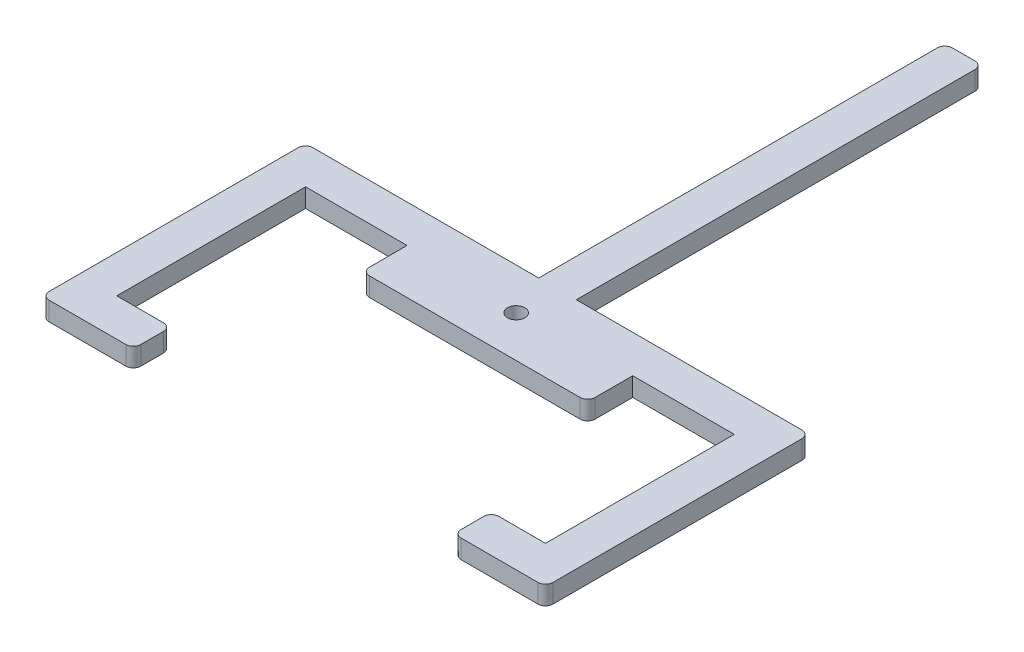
ISO-10303-21;
HEADER;
FILE_DESCRIPTION(('STEP AP214'),'2;1');
FILE_NAME('part.step','',(''),(''),'','','');
FILE_SCHEMA(('AUTOMOTIVE_DESIGN { 1 0 10303 214 1 1 1 1 }'));
ENDSEC;
DATA;
#1=APPLICATION_CONTEXT('core data for automotive mechanical design processes');
#2=APPLICATION_PROTOCOL_DEFINITION('international standard','automotive_design',2000,#1);
#3=PRODUCT_CONTEXT('',#1,'mechanical');
#4=PRODUCT('Part','Part','',(#3));
#5=PRODUCT_RELATED_PRODUCT_CATEGORY('part','',(#4));
#6=PRODUCT_DEFINITION_FORMATION('','',#4);
#7=PRODUCT_DEFINITION_CONTEXT('part definition',#1,'design');
#8=PRODUCT_DEFINITION('design','',#6,#7);
#9=PRODUCT_DEFINITION_SHAPE('','',#8);
#10=(LENGTH_UNIT() NAMED_UNIT(*) SI_UNIT(.MILLI.,.METRE.));
#11=(NAMED_UNIT(*) PLANE_ANGLE_UNIT() SI_UNIT($,.RADIAN.));
#12=(NAMED_UNIT(*) SI_UNIT($,.STERADIAN.) SOLID_ANGLE_UNIT());
#13=UNCERTAINTY_MEASURE_WITH_UNIT(LENGTH_MEASURE(1.E-05),#10,'distance_accuracy_value','');
#14=(GEOMETRIC_REPRESENTATION_CONTEXT(3) GLOBAL_UNCERTAINTY_ASSIGNED_CONTEXT((#13)) GLOBAL_UNIT_ASSIGNED_CONTEXT((#10,
#11,#12)) REPRESENTATION_CONTEXT('',''));
#15=CARTESIAN_POINT('',(0.,0.,0.));
#16=DIRECTION('',(0.,0.,1.));
#17=DIRECTION('',(1.,0.,0.));
#18=AXIS2_PLACEMENT_3D('',#15,#16,#17);
#19=CARTESIAN_POINT('',(39.37,3.175,74.93));
#20=DIRECTION('',(0.,0.,-1.));
#21=DIRECTION('',(-1.,0.,0.));
#22=AXIS2_PLACEMENT_3D('',#19,#20,#21);
#23=PLANE('',#22);
#24=DIRECTION('',(0.,-1.,0.));
#25=VECTOR('',#24,1.);
#26=CARTESIAN_POINT('',(22.225,3.175,74.93));
#27=LINE('',#26,#25);
#28=CARTESIAN_POINT('',(22.225,3.175,74.93));
#29=VERTEX_POINT('',#28);
#30=CARTESIAN_POINT('',(22.225,0.,74.93));
#31=VERTEX_POINT('',#30);
#32=EDGE_CURVE('E250',#29,#31,#27,.T.);
#33=ORIENTED_EDGE('',*,*,#32,.T.);
#34=DIRECTION('',(1.,0.,0.));
#35=VECTOR('',#34,1.);
#36=CARTESIAN_POINT('',(39.37,0.,74.93));
#37=LINE('',#36,#35);
#38=CARTESIAN_POINT('',(39.37,0.,74.93));
#39=VERTEX_POINT('',#38);
#40=EDGE_CURVE('E254',#31,#39,#37,.T.);
#41=ORIENTED_EDGE('',*,*,#40,.T.);
#42=DIRECTION('',(0.,-1.,0.));
#43=VECTOR('',#42,1.);
#44=CARTESIAN_POINT('',(39.37,3.175,74.93));
#45=LINE('',#44,#43);
#46=CARTESIAN_POINT('',(39.37,3.175,74.93));
#47=VERTEX_POINT('',#46);
#48=EDGE_CURVE('E386',#47,#39,#45,.T.);
#49=ORIENTED_EDGE('',*,*,#48,.F.);
#50=DIRECTION('',(1.,0.,0.));
#51=VECTOR('',#50,1.);
#52=CARTESIAN_POINT('',(39.37,3.175,74.93));
#53=LINE('',#52,#51);
#54=EDGE_CURVE('E268',#29,#47,#53,.T.);
#55=ORIENTED_EDGE('',*,*,#54,.F.);
#56=EDGE_LOOP('',(#33,#41,#49,#55));
#57=FACE_BOUND('',#56,.T.);
#58=ADVANCED_FACE('F33',(#57),#23,.F.);
#59=CARTESIAN_POINT('',(0.,3.175,74.93));
#60=DIRECTION('',(0.,0.,-1.));
#61=DIRECTION('',(-1.,0.,0.));
#62=AXIS2_PLACEMENT_3D('',#59,#60,#61);
#63=PLANE('',#62);
#64=DIRECTION('',(0.,-1.,0.));
#65=VECTOR('',#64,1.);
#66=CARTESIAN_POINT('',(-15.875,3.175,74.93));
#67=LINE('',#66,#65);
#68=CARTESIAN_POINT('',(-15.875,3.175,74.93));
#69=VERTEX_POINT('',#68);
#70=CARTESIAN_POINT('',(-15.875,0.,74.93));
#71=VERTEX_POINT('',#70);
#72=EDGE_CURVE('E269',#69,#71,#67,.T.);
#73=ORIENTED_EDGE('',*,*,#72,.F.);
#74=DIRECTION('',(1.,0.,0.));
#75=VECTOR('',#74,1.);
#76=CARTESIAN_POINT('',(0.,3.175,74.93));
#77=LINE('',#76,#75);
#78=CARTESIAN_POINT('',(-33.02,3.175,74.93));
#79=VERTEX_POINT('',#78);
#80=EDGE_CURVE('E332',#79,#69,#77,.T.);
#81=ORIENTED_EDGE('',*,*,#80,.F.);
#82=DIRECTION('',(0.,-1.,0.));
#83=VECTOR('',#82,1.);
#84=CARTESIAN_POINT('',(-33.02,3.175,74.93));
#85=LINE('',#84,#83);
#86=CARTESIAN_POINT('',(-33.02,0.,74.93));
#87=VERTEX_POINT('',#86);
#88=EDGE_CURVE('E388',#79,#87,#85,.T.);
#89=ORIENTED_EDGE('',*,*,#88,.T.);
#90=DIRECTION('',(1.,0.,0.));
#91=VECTOR('',#90,1.);
#92=CARTESIAN_POINT('',(0.,0.,74.93));
#93=LINE('',#92,#91);
#94=EDGE_CURVE('E368',#87,#71,#93,.T.);
#95=ORIENTED_EDGE('',*,*,#94,.T.);
#96=EDGE_LOOP('',(#73,#81,#89,#95));
#97=FACE_BOUND('',#96,.T.);
#98=ADVANCED_FACE('F562',(#97),#63,.F.);
#99=CARTESIAN_POINT('',(39.37,3.175,74.93));
#100=DIRECTION('',(1.,0.,0.));
#101=DIRECTION('',(0.,0.,-1.));
#102=AXIS2_PLACEMENT_3D('',#99,#100,#101);
#103=PLANE('',#102);
#104=DIRECTION('',(0.,-1.,0.));
#105=VECTOR('',#104,1.);
#106=CARTESIAN_POINT('',(39.37,3.175,106.807));
#107=LINE('',#106,#105);
#108=CARTESIAN_POINT('',(39.37,3.175,106.807));
#109=VERTEX_POINT('',#108);
#110=CARTESIAN_POINT('',(39.37,0.,106.807));
#111=VERTEX_POINT('',#110);
#112=EDGE_CURVE('E291',#109,#111,#107,.T.);
#113=ORIENTED_EDGE('',*,*,#112,.F.);
#114=DIRECTION('',(0.,0.,1.));
#115=VECTOR('',#114,1.);
#116=CARTESIAN_POINT('',(39.37,3.175,74.93));
#117=LINE('',#116,#115);
#118=EDGE_CURVE('E344',#47,#109,#117,.T.);
#119=ORIENTED_EDGE('',*,*,#118,.F.);
#120=ORIENTED_EDGE('',*,*,#48,.T.);
#121=DIRECTION('',(0.,0.,1.));
#122=VECTOR('',#121,1.);
#123=CARTESIAN_POINT('',(39.37,0.,74.93));
#124=LINE('',#123,#122);
#125=EDGE_CURVE('E262',#39,#111,#124,.T.);
#126=ORIENTED_EDGE('',*,*,#125,.T.);
#127=EDGE_LOOP('',(#113,#119,#120,#126));
#128=FACE_BOUND('',#127,.T.);
#129=ADVANCED_FACE('F580',(#128),#103,.F.);
#130=CARTESIAN_POINT('',(-33.02,3.175,74.93));
#131=DIRECTION('',(-1.,0.,0.));
#132=DIRECTION('',(0.,0.,1.));
#133=AXIS2_PLACEMENT_3D('',#130,#131,#132);
#134=PLANE('',#133);
#135=DIRECTION('',(0.,1.,0.));
#136=VECTOR('',#135,1.);
#137=CARTESIAN_POINT('',(-33.02,3.175,106.807));
#138=LINE('',#137,#136);
#139=CARTESIAN_POINT('',(-33.02,0.,106.807));
#140=VERTEX_POINT('',#139);
#141=CARTESIAN_POINT('',(-33.02,3.175,106.807));
#142=VERTEX_POINT('',#141);
#143=EDGE_CURVE('E310',#140,#142,#138,.T.);
#144=ORIENTED_EDGE('',*,*,#143,.F.);
#145=DIRECTION('',(0.,0.,-1.));
#146=VECTOR('',#145,1.);
#147=CARTESIAN_POINT('',(-33.02,0.,74.93));
#148=LINE('',#147,#146);
#149=EDGE_CURVE('E366',#140,#87,#148,.T.);
#150=ORIENTED_EDGE('',*,*,#149,.T.);
#151=ORIENTED_EDGE('',*,*,#88,.F.);
#152=DIRECTION('',(0.,0.,-1.));
#153=VECTOR('',#152,1.);
#154=CARTESIAN_POINT('',(-33.02,3.175,74.93));
#155=LINE('',#154,#153);
#156=EDGE_CURVE('E330',#142,#79,#155,.T.);
#157=ORIENTED_EDGE('',*,*,#156,.F.);
#158=EDGE_LOOP('',(#144,#150,#151,#157));
#159=FACE_BOUND('',#158,.T.);
#160=ADVANCED_FACE('F557',(#159),#134,.F.);
#161=CARTESIAN_POINT('',(6.35,3.175,0.));
#162=DIRECTION('',(0.,0.,1.));
#163=DIRECTION('',(1.,0.,0.));
#164=AXIS2_PLACEMENT_3D('',#161,#162,#163);
#165=PLANE('',#164);
#166=DIRECTION('',(-1.,0.,0.));
#167=VECTOR('',#166,1.);
#168=CARTESIAN_POINT('',(6.35,3.175,0.));
#169=LINE('',#168,#167);
#170=CARTESIAN_POINT('',(5.08,3.175,0.));
#171=VERTEX_POINT('',#170);
#172=CARTESIAN_POINT('',(1.27,3.175,0.));
#173=VERTEX_POINT('',#172);
#174=EDGE_CURVE('E319',#171,#173,#169,.T.);
#175=ORIENTED_EDGE('',*,*,#174,.F.);
#176=DIRECTION('',(0.,-1.,0.));
#177=VECTOR('',#176,1.);
#178=CARTESIAN_POINT('',(5.08,3.175,0.));
#179=LINE('',#178,#177);
#180=CARTESIAN_POINT('',(5.08,0.,0.));
#181=VERTEX_POINT('',#180);
#182=EDGE_CURVE('E490',#171,#181,#179,.T.);
#183=ORIENTED_EDGE('',*,*,#182,.T.);
#184=DIRECTION('',(-1.,0.,0.));
#185=VECTOR('',#184,1.);
#186=CARTESIAN_POINT('',(6.35,0.,0.));
#187=LINE('',#186,#185);
#188=CARTESIAN_POINT('',(1.27,0.,0.));
#189=VERTEX_POINT('',#188);
#190=EDGE_CURVE('E318',#181,#189,#187,.T.);
#191=ORIENTED_EDGE('',*,*,#190,.T.);
#192=DIRECTION('',(0.,-1.,0.));
#193=VECTOR('',#192,1.);
#194=CARTESIAN_POINT('',(1.27,3.175,0.));
#195=LINE('',#194,#193);
#196=EDGE_CURVE('E488',#189,#173,#195,.F.);
#197=ORIENTED_EDGE('',*,*,#196,.T.);
#198=EDGE_LOOP('',(#175,#183,#191,#197));
#199=FACE_BOUND('',#198,.T.);
#200=ADVANCED_FACE('F508',(#199),#165,.F.);
#201=CARTESIAN_POINT('',(0.,3.175,0.));
#202=DIRECTION('',(1.,0.,0.));
#203=DIRECTION('',(0.,0.,-1.));
#204=AXIS2_PLACEMENT_3D('',#201,#202,#203);
#205=PLANE('',#204);
#206=DIRECTION('',(0.,0.,1.));
#207=VECTOR('',#206,1.);
#208=CARTESIAN_POINT('',(0.,3.175,0.));
#209=LINE('',#208,#207);
#210=CARTESIAN_POINT('',(0.,3.175,1.27));
#211=VERTEX_POINT('',#210);
#212=CARTESIAN_POINT('',(0.,3.175,68.58));
#213=VERTEX_POINT('',#212);
#214=EDGE_CURVE('E322',#211,#213,#209,.T.);
#215=ORIENTED_EDGE('',*,*,#214,.F.);
#216=DIRECTION('',(0.,-1.,0.));
#217=VECTOR('',#216,1.);
#218=CARTESIAN_POINT('',(0.,3.175,1.27));
#219=LINE('',#218,#217);
#220=CARTESIAN_POINT('',(0.,0.,1.27));
#221=VERTEX_POINT('',#220);
#222=EDGE_CURVE('E11',#211,#221,#219,.T.);
#223=ORIENTED_EDGE('',*,*,#222,.T.);
#224=DIRECTION('',(0.,0.,1.));
#225=VECTOR('',#224,1.);
#226=CARTESIAN_POINT('',(0.,0.,0.));
#227=LINE('',#226,#225);
#228=CARTESIAN_POINT('',(0.,0.,68.58));
#229=VERTEX_POINT('',#228);
#230=EDGE_CURVE('E358',#221,#229,#227,.T.);
#231=ORIENTED_EDGE('',*,*,#230,.T.);
#232=DIRECTION('',(0.,-1.,0.));
#233=VECTOR('',#232,1.);
#234=CARTESIAN_POINT('',(0.,3.175,68.58));
#235=LINE('',#234,#233);
#236=EDGE_CURVE('E391',#213,#229,#235,.T.);
#237=ORIENTED_EDGE('',*,*,#236,.F.);
#238=EDGE_LOOP('',(#215,#223,#231,#237));
#239=FACE_BOUND('',#238,.T.);
#240=ADVANCED_FACE('F517',(#239),#205,.F.);
#241=CARTESIAN_POINT('',(0.,3.175,68.58));
#242=DIRECTION('',(0.,0.,1.));
#243=DIRECTION('',(1.,0.,0.));
#244=AXIS2_PLACEMENT_3D('',#241,#242,#243);
#245=PLANE('',#244);
#246=DIRECTION('',(-1.,0.,0.));
#247=VECTOR('',#246,1.);
#248=CARTESIAN_POINT('',(0.,0.,68.58));
#249=LINE('',#248,#247);
#250=CARTESIAN_POINT('',(-38.1,0.,68.58));
#251=VERTEX_POINT('',#250);
#252=EDGE_CURVE('E360',#229,#251,#249,.T.);
#253=ORIENTED_EDGE('',*,*,#252,.T.);
#254=DIRECTION('',(0.,-1.,0.));
#255=VECTOR('',#254,1.);
#256=CARTESIAN_POINT('',(-38.1,3.175,68.58));
#257=LINE('',#256,#255);
#258=CARTESIAN_POINT('',(-38.1,3.175,68.58));
#259=VERTEX_POINT('',#258);
#260=EDGE_CURVE('E486',#251,#259,#257,.F.);
#261=ORIENTED_EDGE('',*,*,#260,.T.);
#262=DIRECTION('',(-1.,0.,0.));
#263=VECTOR('',#262,1.);
#264=CARTESIAN_POINT('',(0.,3.175,68.58));
#265=LINE('',#264,#263);
#266=EDGE_CURVE('E325',#213,#259,#265,.T.);
#267=ORIENTED_EDGE('',*,*,#266,.F.);
#268=ORIENTED_EDGE('',*,*,#236,.T.);
#269=EDGE_LOOP('',(#253,#261,#267,#268));
#270=FACE_BOUND('',#269,.T.);
#271=ADVANCED_FACE('F645',(#270),#245,.F.);
#272=CARTESIAN_POINT('',(-39.37,3.175,68.58));
#273=DIRECTION('',(1.,0.,0.));
#274=DIRECTION('',(0.,0.,-1.));
#275=AXIS2_PLACEMENT_3D('',#272,#273,#274);
#276=PLANE('',#275);
#277=DIRECTION('',(0.,0.,1.));
#278=VECTOR('',#277,1.);
#279=CARTESIAN_POINT('',(-39.37,0.,68.58));
#280=LINE('',#279,#278);
#281=CARTESIAN_POINT('',(-39.37,0.,69.85));
#282=VERTEX_POINT('',#281);
#283=CARTESIAN_POINT('',(-39.37,0.,111.887));
#284=VERTEX_POINT('',#283);
#285=EDGE_CURVE('E363',#282,#284,#280,.T.);
#286=ORIENTED_EDGE('',*,*,#285,.T.);
#287=DIRECTION('',(0.,-1.,0.));
#288=VECTOR('',#287,1.);
#289=CARTESIAN_POINT('',(-39.37,3.175,111.887));
#290=LINE('',#289,#288);
#291=CARTESIAN_POINT('',(-39.37,3.175,111.887));
#292=VERTEX_POINT('',#291);
#293=EDGE_CURVE('E479',#284,#292,#290,.F.);
#294=ORIENTED_EDGE('',*,*,#293,.T.);
#295=DIRECTION('',(0.,0.,1.));
#296=VECTOR('',#295,1.);
#297=CARTESIAN_POINT('',(-39.37,3.175,68.58));
#298=LINE('',#297,#296);
#299=CARTESIAN_POINT('',(-39.37,3.175,69.85));
#300=VERTEX_POINT('',#299);
#301=EDGE_CURVE('E328',#300,#292,#298,.T.);
#302=ORIENTED_EDGE('',*,*,#301,.F.);
#303=DIRECTION('',(0.,-1.,0.));
#304=VECTOR('',#303,1.);
#305=CARTESIAN_POINT('',(-39.37,3.175,69.85));
#306=LINE('',#305,#304);
#307=EDGE_CURVE('E476',#300,#282,#306,.T.);
#308=ORIENTED_EDGE('',*,*,#307,.T.);
#309=EDGE_LOOP('',(#286,#294,#302,#308));
#310=FACE_BOUND('',#309,.T.);
#311=ADVANCED_FACE('F529',(#310),#276,.F.);
#312=CARTESIAN_POINT('',(-15.875,3.175,79.375));
#313=DIRECTION('',(1.,0.,0.));
#314=DIRECTION('',(0.,0.,-1.));
#315=AXIS2_PLACEMENT_3D('',#312,#313,#314);
#316=PLANE('',#315);
#317=DIRECTION('',(0.,0.,1.));
#318=VECTOR('',#317,1.);
#319=CARTESIAN_POINT('',(-15.875,0.,79.375));
#320=LINE('',#319,#318);
#321=CARTESIAN_POINT('',(-15.875,0.,81.28));
#322=VERTEX_POINT('',#321);
#323=EDGE_CURVE('E371',#71,#322,#320,.T.);
#324=ORIENTED_EDGE('',*,*,#323,.T.);
#325=DIRECTION('',(0.,-1.,0.));
#326=VECTOR('',#325,1.);
#327=CARTESIAN_POINT('',(-15.875,3.175,81.28));
#328=LINE('',#327,#326);
#329=CARTESIAN_POINT('',(-15.875,3.175,81.28));
#330=VERTEX_POINT('',#329);
#331=EDGE_CURVE('E481',#322,#330,#328,.F.);
#332=ORIENTED_EDGE('',*,*,#331,.T.);
#333=DIRECTION('',(0.,0.,1.));
#334=VECTOR('',#333,1.);
#335=CARTESIAN_POINT('',(-15.875,3.175,79.375));
#336=LINE('',#335,#334);
#337=EDGE_CURVE('E335',#69,#330,#336,.T.);
#338=ORIENTED_EDGE('',*,*,#337,.F.);
#339=ORIENTED_EDGE('',*,*,#72,.T.);
#340=EDGE_LOOP('',(#324,#332,#338,#339));
#341=FACE_BOUND('',#340,.T.);
#342=ADVANCED_FACE('F638',(#341),#316,.F.);
#343=CARTESIAN_POINT('',(-15.875,3.175,82.55));
#344=DIRECTION('',(0.,0.,-1.));
#345=DIRECTION('',(-1.,0.,0.));
#346=AXIS2_PLACEMENT_3D('',#343,#344,#345);
#347=PLANE('',#346);
#348=DIRECTION('',(1.,0.,0.));
#349=VECTOR('',#348,1.);
#350=CARTESIAN_POINT('',(-15.875,0.,82.55));
#351=LINE('',#350,#349);
#352=CARTESIAN_POINT('',(-14.605,0.,82.55));
#353=VERTEX_POINT('',#352);
#354=CARTESIAN_POINT('',(20.955,0.,82.55));
#355=VERTEX_POINT('',#354);
#356=EDGE_CURVE('E255',#353,#355,#351,.T.);
#357=ORIENTED_EDGE('',*,*,#356,.T.);
#358=DIRECTION('',(0.,-1.,0.));
#359=VECTOR('',#358,1.);
#360=CARTESIAN_POINT('',(20.955,3.175,82.55));
#361=LINE('',#360,#359);
#362=CARTESIAN_POINT('',(20.955,3.175,82.55));
#363=VERTEX_POINT('',#362);
#364=EDGE_CURVE('E470',#355,#363,#361,.F.);
#365=ORIENTED_EDGE('',*,*,#364,.T.);
#366=DIRECTION('',(1.,0.,0.));
#367=VECTOR('',#366,1.);
#368=CARTESIAN_POINT('',(-15.875,3.175,82.55));
#369=LINE('',#368,#367);
#370=CARTESIAN_POINT('',(-14.605,3.175,82.55));
#371=VERTEX_POINT('',#370);
#372=EDGE_CURVE('E338',#371,#363,#369,.T.);
#373=ORIENTED_EDGE('',*,*,#372,.F.);
#374=DIRECTION('',(0.,-1.,0.));
#375=VECTOR('',#374,1.);
#376=CARTESIAN_POINT('',(-14.605,3.175,82.55));
#377=LINE('',#376,#375);
#378=EDGE_CURVE('E467',#371,#353,#377,.T.);
#379=ORIENTED_EDGE('',*,*,#378,.T.);
#380=EDGE_LOOP('',(#357,#365,#373,#379));
#381=FACE_BOUND('',#380,.T.);
#382=ADVANCED_FACE('F572',(#381),#347,.F.);
#383=CARTESIAN_POINT('',(22.225,3.175,79.375));
#384=DIRECTION('',(-1.,0.,0.));
#385=DIRECTION('',(0.,0.,1.));
#386=AXIS2_PLACEMENT_3D('',#383,#384,#385);
#387=PLANE('',#386);
#388=DIRECTION('',(0.,0.,-1.));
#389=VECTOR('',#388,1.);
#390=CARTESIAN_POINT('',(22.225,3.175,79.375));
#391=LINE('',#390,#389);
#392=CARTESIAN_POINT('',(22.225,3.175,81.28));
#393=VERTEX_POINT('',#392);
#394=EDGE_CURVE('E341',#393,#29,#391,.T.);
#395=ORIENTED_EDGE('',*,*,#394,.F.);
#396=DIRECTION('',(0.,-1.,0.));
#397=VECTOR('',#396,1.);
#398=CARTESIAN_POINT('',(22.225,3.175,81.28));
#399=LINE('',#398,#397);
#400=CARTESIAN_POINT('',(22.225,0.,81.28));
#401=VERTEX_POINT('',#400);
#402=EDGE_CURVE('E252',#393,#401,#399,.T.);
#403=ORIENTED_EDGE('',*,*,#402,.T.);
#404=DIRECTION('',(0.,0.,-1.));
#405=VECTOR('',#404,1.);
#406=CARTESIAN_POINT('',(22.225,0.,79.375));
#407=LINE('',#406,#405);
#408=EDGE_CURVE('E245',#401,#31,#407,.T.);
#409=ORIENTED_EDGE('',*,*,#408,.T.);
#410=ORIENTED_EDGE('',*,*,#32,.F.);
#411=EDGE_LOOP('',(#395,#403,#409,#410));
#412=FACE_BOUND('',#411,.T.);
#413=ADVANCED_FACE('F248',(#412),#387,.F.);
#414=CARTESIAN_POINT('',(45.72,3.175,68.58));
#415=DIRECTION('',(-1.,0.,0.));
#416=DIRECTION('',(0.,0.,1.));
#417=AXIS2_PLACEMENT_3D('',#414,#415,#416);
#418=PLANE('',#417);
#419=DIRECTION('',(0.,0.,-1.));
#420=VECTOR('',#419,1.);
#421=CARTESIAN_POINT('',(45.72,3.175,68.58));
#422=LINE('',#421,#420);
#423=CARTESIAN_POINT('',(45.72,3.175,111.887));
#424=VERTEX_POINT('',#423);
#425=CARTESIAN_POINT('',(45.72,3.175,69.85));
#426=VERTEX_POINT('',#425);
#427=EDGE_CURVE('E347',#424,#426,#422,.T.);
#428=ORIENTED_EDGE('',*,*,#427,.F.);
#429=DIRECTION('',(0.,-1.,0.));
#430=VECTOR('',#429,1.);
#431=CARTESIAN_POINT('',(45.72,3.175,111.887));
#432=LINE('',#431,#430);
#433=CARTESIAN_POINT('',(45.72,0.,111.887));
#434=VERTEX_POINT('',#433);
#435=EDGE_CURVE('E451',#424,#434,#432,.T.);
#436=ORIENTED_EDGE('',*,*,#435,.T.);
#437=DIRECTION('',(0.,0.,-1.));
#438=VECTOR('',#437,1.);
#439=CARTESIAN_POINT('',(45.72,0.,68.58));
#440=LINE('',#439,#438);
#441=CARTESIAN_POINT('',(45.72,0.,69.85));
#442=VERTEX_POINT('',#441);
#443=EDGE_CURVE('E377',#434,#442,#440,.T.);
#444=ORIENTED_EDGE('',*,*,#443,.T.);
#445=DIRECTION('',(0.,-1.,0.));
#446=VECTOR('',#445,1.);
#447=CARTESIAN_POINT('',(45.72,3.175,69.85));
#448=LINE('',#447,#446);
#449=EDGE_CURVE('E449',#442,#426,#448,.F.);
#450=ORIENTED_EDGE('',*,*,#449,.T.);
#451=EDGE_LOOP('',(#428,#436,#444,#450));
#452=FACE_BOUND('',#451,.T.);
#453=ADVANCED_FACE('F609',(#452),#418,.F.);
#454=CARTESIAN_POINT('',(6.34999999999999,3.175,68.58));
#455=DIRECTION('',(0.,0.,1.));
#456=DIRECTION('',(1.,0.,0.));
#457=AXIS2_PLACEMENT_3D('',#454,#455,#456);
#458=PLANE('',#457);
#459=DIRECTION('',(-1.,0.,0.));
#460=VECTOR('',#459,1.);
#461=CARTESIAN_POINT('',(6.34999999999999,3.175,68.58));
#462=LINE('',#461,#460);
#463=CARTESIAN_POINT('',(44.45,3.175,68.58));
#464=VERTEX_POINT('',#463);
#465=CARTESIAN_POINT('',(6.34999999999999,3.175,68.58));
#466=VERTEX_POINT('',#465);
#467=EDGE_CURVE('E350',#464,#466,#462,.T.);
#468=ORIENTED_EDGE('',*,*,#467,.F.);
#469=DIRECTION('',(0.,-1.,0.));
#470=VECTOR('',#469,1.);
#471=CARTESIAN_POINT('',(44.45,3.175,68.58));
#472=LINE('',#471,#470);
#473=CARTESIAN_POINT('',(44.45,0.,68.58));
#474=VERTEX_POINT('',#473);
#475=EDGE_CURVE('E483',#464,#474,#472,.T.);
#476=ORIENTED_EDGE('',*,*,#475,.T.);
#477=DIRECTION('',(-1.,0.,0.));
#478=VECTOR('',#477,1.);
#479=CARTESIAN_POINT('',(6.34999999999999,0.,68.58));
#480=LINE('',#479,#478);
#481=CARTESIAN_POINT('',(6.34999999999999,0.,68.58));
#482=VERTEX_POINT('',#481);
#483=EDGE_CURVE('E380',#474,#482,#480,.T.);
#484=ORIENTED_EDGE('',*,*,#483,.T.);
#485=DIRECTION('',(0.,-1.,0.));
#486=VECTOR('',#485,1.);
#487=CARTESIAN_POINT('',(6.34999999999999,3.175,68.58));
#488=LINE('',#487,#486);
#489=EDGE_CURVE('E355',#466,#482,#488,.T.);
#490=ORIENTED_EDGE('',*,*,#489,.F.);
#491=EDGE_LOOP('',(#468,#476,#484,#490));
#492=FACE_BOUND('',#491,.T.);
#493=ADVANCED_FACE('F617',(#492),#458,.F.);
#494=CARTESIAN_POINT('',(6.34999999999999,3.175,68.58));
#495=DIRECTION('',(-1.,0.,0.));
#496=DIRECTION('',(0.,0.,1.));
#497=AXIS2_PLACEMENT_3D('',#494,#495,#496);
#498=PLANE('',#497);
#499=DIRECTION('',(0.,0.,-1.));
#500=VECTOR('',#499,1.);
#501=CARTESIAN_POINT('',(6.34999999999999,0.,68.58));
#502=LINE('',#501,#500);
#503=CARTESIAN_POINT('',(6.35,0.,1.26999999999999));
#504=VERTEX_POINT('',#503);
#505=EDGE_CURVE('E323',#482,#504,#502,.T.);
#506=ORIENTED_EDGE('',*,*,#505,.T.);
#507=DIRECTION('',(0.,-1.,0.));
#508=VECTOR('',#507,1.);
#509=CARTESIAN_POINT('',(6.35,3.175,1.26999999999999));
#510=LINE('',#509,#508);
#511=CARTESIAN_POINT('',(6.35,3.175,1.26999999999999));
#512=VERTEX_POINT('',#511);
#513=EDGE_CURVE('E41',#504,#512,#510,.F.);
#514=ORIENTED_EDGE('',*,*,#513,.T.);
#515=DIRECTION('',(0.,0.,-1.));
#516=VECTOR('',#515,1.);
#517=CARTESIAN_POINT('',(6.34999999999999,3.175,68.58));
#518=LINE('',#517,#516);
#519=EDGE_CURVE('E352',#466,#512,#518,.T.);
#520=ORIENTED_EDGE('',*,*,#519,.F.);
#521=ORIENTED_EDGE('',*,*,#489,.T.);
#522=EDGE_LOOP('',(#506,#514,#520,#521));
#523=FACE_BOUND('',#522,.T.);
#524=ADVANCED_FACE('F495',(#523),#498,.F.);
#525=CARTESIAN_POINT('',(0.,3.175,0.));
#526=DIRECTION('',(0.,1.,0.));
#527=DIRECTION('',(0.,0.,1.));
#528=AXIS2_PLACEMENT_3D('',#525,#526,#527);
#529=PLANE('',#528);
#530=DIRECTION('',(0.,0.,-1.));
#531=VECTOR('',#530,1.);
#532=CARTESIAN_POINT('',(-23.876,3.175,106.807));
#533=LINE('',#532,#531);
#534=CARTESIAN_POINT('',(-23.876,3.175,111.887));
#535=VERTEX_POINT('',#534);
#536=CARTESIAN_POINT('',(-23.876,3.175,108.077));
#537=VERTEX_POINT('',#536);
#538=EDGE_CURVE('E304',#535,#537,#533,.T.);
#539=ORIENTED_EDGE('',*,*,#538,.T.);
#540=CARTESIAN_POINT('',(-25.146,3.175,108.077));
#541=DIRECTION('',(0.,1.,0.));
#542=DIRECTION('',(0.,0.,1.));
#543=AXIS2_PLACEMENT_3D('',#540,#541,#542);
#544=CIRCLE('',#543,1.27);
#545=CARTESIAN_POINT('',(-25.146,3.175,106.807));
#546=VERTEX_POINT('',#545);
#547=EDGE_CURVE('E447',#537,#546,#544,.T.);
#548=ORIENTED_EDGE('',*,*,#547,.T.);
#549=DIRECTION('',(-1.,0.,0.));
#550=VECTOR('',#549,1.);
#551=CARTESIAN_POINT('',(-39.37,3.175,106.807));
#552=LINE('',#551,#550);
#553=EDGE_CURVE('E308',#546,#142,#552,.T.);
#554=ORIENTED_EDGE('',*,*,#553,.T.);
#555=ORIENTED_EDGE('',*,*,#156,.T.);
#556=ORIENTED_EDGE('',*,*,#80,.T.);
#557=ORIENTED_EDGE('',*,*,#337,.T.);
#558=CARTESIAN_POINT('',(-14.605,3.175,81.28));
#559=DIRECTION('',(0.,1.,0.));
#560=DIRECTION('',(0.,0.,1.));
#561=AXIS2_PLACEMENT_3D('',#558,#559,#560);
#562=CIRCLE('',#561,1.27);
#563=EDGE_CURVE('E434',#330,#371,#562,.T.);
#564=ORIENTED_EDGE('',*,*,#563,.T.);
#565=ORIENTED_EDGE('',*,*,#372,.T.);
#566=CARTESIAN_POINT('',(20.955,3.175,81.28));
#567=DIRECTION('',(0.,1.,0.));
#568=DIRECTION('',(0.,0.,1.));
#569=AXIS2_PLACEMENT_3D('',#566,#567,#568);
#570=CIRCLE('',#569,1.27);
#571=EDGE_CURVE('E439',#363,#393,#570,.T.);
#572=ORIENTED_EDGE('',*,*,#571,.T.);
#573=ORIENTED_EDGE('',*,*,#394,.T.);
#574=ORIENTED_EDGE('',*,*,#54,.T.);
#575=ORIENTED_EDGE('',*,*,#118,.T.);
#576=DIRECTION('',(-1.,0.,0.));
#577=VECTOR('',#576,1.);
#578=CARTESIAN_POINT('',(45.72,3.175,106.807));
#579=LINE('',#578,#577);
#580=CARTESIAN_POINT('',(31.496,3.175,106.807));
#581=VERTEX_POINT('',#580);
#582=EDGE_CURVE('E281',#109,#581,#579,.T.);
#583=ORIENTED_EDGE('',*,*,#582,.T.);
#584=CARTESIAN_POINT('',(31.496,3.175,108.077));
#585=DIRECTION('',(0.,1.,0.));
#586=DIRECTION('',(0.,0.,1.));
#587=AXIS2_PLACEMENT_3D('',#584,#585,#586);
#588=CIRCLE('',#587,1.27);
#589=CARTESIAN_POINT('',(30.226,3.175,108.077));
#590=VERTEX_POINT('',#589);
#591=EDGE_CURVE('E443',#581,#590,#588,.T.);
#592=ORIENTED_EDGE('',*,*,#591,.T.);
#593=DIRECTION('',(0.,0.,1.));
#594=VECTOR('',#593,1.);
#595=CARTESIAN_POINT('',(30.226,3.175,106.807));
#596=LINE('',#595,#594);
#597=CARTESIAN_POINT('',(30.226,3.175,111.887));
#598=VERTEX_POINT('',#597);
#599=EDGE_CURVE('E284',#590,#598,#596,.T.);
#600=ORIENTED_EDGE('',*,*,#599,.T.);
#601=CARTESIAN_POINT('',(31.496,3.175,111.887));
#602=DIRECTION('',(0.,1.,0.));
#603=DIRECTION('',(0.,0.,1.));
#604=AXIS2_PLACEMENT_3D('',#601,#602,#603);
#605=CIRCLE('',#604,1.27);
#606=CARTESIAN_POINT('',(31.496,3.175,113.157));
#607=VERTEX_POINT('',#606);
#608=EDGE_CURVE('E441',#598,#607,#605,.T.);
#609=ORIENTED_EDGE('',*,*,#608,.T.);
#610=DIRECTION('',(1.,0.,0.));
#611=VECTOR('',#610,1.);
#612=CARTESIAN_POINT('',(45.72,3.175,113.157));
#613=LINE('',#612,#611);
#614=CARTESIAN_POINT('',(44.45,3.175,113.157));
#615=VERTEX_POINT('',#614);
#616=EDGE_CURVE('E288',#607,#615,#613,.T.);
#617=ORIENTED_EDGE('',*,*,#616,.T.);
#618=CARTESIAN_POINT('',(44.45,3.175,111.887));
#619=DIRECTION('',(0.,1.,0.));
#620=DIRECTION('',(0.,0.,1.));
#621=AXIS2_PLACEMENT_3D('',#618,#619,#620);
#622=CIRCLE('',#621,1.27);
#623=EDGE_CURVE('E445',#615,#424,#622,.T.);
#624=ORIENTED_EDGE('',*,*,#623,.T.);
#625=ORIENTED_EDGE('',*,*,#427,.T.);
#626=CARTESIAN_POINT('',(44.45,3.175,69.85));
#627=DIRECTION('',(0.,1.,0.));
#628=DIRECTION('',(0.,0.,1.));
#629=AXIS2_PLACEMENT_3D('',#626,#627,#628);
#630=CIRCLE('',#629,1.27);
#631=EDGE_CURVE('E432',#426,#464,#630,.T.);
#632=ORIENTED_EDGE('',*,*,#631,.T.);
#633=ORIENTED_EDGE('',*,*,#467,.T.);
#634=ORIENTED_EDGE('',*,*,#519,.T.);
#635=CARTESIAN_POINT('',(5.08,3.175,1.27));
#636=DIRECTION('',(0.,1.,0.));
#637=DIRECTION('',(0.,0.,1.));
#638=AXIS2_PLACEMENT_3D('',#635,#636,#637);
#639=CIRCLE('',#638,1.27);
#640=EDGE_CURVE('E428',#512,#171,#639,.T.);
#641=ORIENTED_EDGE('',*,*,#640,.T.);
#642=ORIENTED_EDGE('',*,*,#174,.T.);
#643=CARTESIAN_POINT('',(1.27,3.175,1.27));
#644=DIRECTION('',(0.,1.,0.));
#645=DIRECTION('',(0.,0.,1.));
#646=AXIS2_PLACEMENT_3D('',#643,#644,#645);
#647=CIRCLE('',#646,1.27);
#648=EDGE_CURVE('E426',#173,#211,#647,.T.);
#649=ORIENTED_EDGE('',*,*,#648,.T.);
#650=ORIENTED_EDGE('',*,*,#214,.T.);
#651=ORIENTED_EDGE('',*,*,#266,.T.);
#652=CARTESIAN_POINT('',(-38.1,3.175,69.85));
#653=DIRECTION('',(0.,1.,0.));
#654=DIRECTION('',(0.,0.,1.));
#655=AXIS2_PLACEMENT_3D('',#652,#653,#654);
#656=CIRCLE('',#655,1.27);
#657=EDGE_CURVE('E430',#259,#300,#656,.T.);
#658=ORIENTED_EDGE('',*,*,#657,.T.);
#659=ORIENTED_EDGE('',*,*,#301,.T.);
#660=CARTESIAN_POINT('',(-38.1,3.175,111.887));
#661=DIRECTION('',(0.,1.,0.));
#662=DIRECTION('',(0.,0.,1.));
#663=AXIS2_PLACEMENT_3D('',#660,#661,#662);
#664=CIRCLE('',#663,1.27);
#665=CARTESIAN_POINT('',(-38.1,3.175,113.157));
#666=VERTEX_POINT('',#665);
#667=EDGE_CURVE('E55',#292,#666,#664,.T.);
#668=ORIENTED_EDGE('',*,*,#667,.T.);
#669=DIRECTION('',(1.,0.,0.));
#670=VECTOR('',#669,1.);
#671=CARTESIAN_POINT('',(-39.37,3.175,113.157));
#672=LINE('',#671,#670);
#673=CARTESIAN_POINT('',(-25.146,3.175,113.157));
#674=VERTEX_POINT('',#673);
#675=EDGE_CURVE('E302',#666,#674,#672,.T.);
#676=ORIENTED_EDGE('',*,*,#675,.T.);
#677=CARTESIAN_POINT('',(-25.146,3.175,111.887));
#678=DIRECTION('',(0.,1.,0.));
#679=DIRECTION('',(0.,0.,1.));
#680=AXIS2_PLACEMENT_3D('',#677,#678,#679);
#681=CIRCLE('',#680,1.27);
#682=EDGE_CURVE('E437',#674,#535,#681,.T.);
#683=ORIENTED_EDGE('',*,*,#682,.T.);
#684=EDGE_LOOP('',(#539,#548,#554,#555,#556,#557,#564,#565,#572,#573,#574,#575,#583,#592,#600,
#609,#617,#624,#625,#632,#633,#634,#641,#642,#649,#650,#651,#658,#659,#668,#676,#683));
#685=FACE_BOUND('',#684,.T.);
#686=CARTESIAN_POINT('',(3.175,3.175,75.565));
#687=DIRECTION('',(0.,1.,0.));
#688=DIRECTION('',(0.,0.,1.));
#689=AXIS2_PLACEMENT_3D('',#686,#687,#688);
#690=CIRCLE('',#689,1.47319999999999);
#691=CARTESIAN_POINT('',(3.175,3.175,77.0382));
#692=VERTEX_POINT('',#691);
#693=EDGE_CURVE('E272',#692,#692,#690,.T.);
#694=ORIENTED_EDGE('',*,*,#693,.F.);
#695=EDGE_LOOP('',(#694));
#696=FACE_BOUND('',#695,.T.);
#697=ADVANCED_FACE('F499',(#685,#696),#529,.T.);
#698=CARTESIAN_POINT('',(0.,0.,0.));
#699=DIRECTION('',(0.,1.,0.));
#700=DIRECTION('',(0.,0.,1.));
#701=AXIS2_PLACEMENT_3D('',#698,#699,#700);
#702=PLANE('',#701);
#703=DIRECTION('',(-1.,0.,0.));
#704=VECTOR('',#703,1.);
#705=CARTESIAN_POINT('',(-39.37,0.,106.807));
#706=LINE('',#705,#704);
#707=CARTESIAN_POINT('',(-25.146,0.,106.807));
#708=VERTEX_POINT('',#707);
#709=EDGE_CURVE('E305',#708,#140,#706,.T.);
#710=ORIENTED_EDGE('',*,*,#709,.F.);
#711=CARTESIAN_POINT('',(-25.146,0.,108.077));
#712=DIRECTION('',(0.,1.,0.));
#713=DIRECTION('',(0.,0.,1.));
#714=AXIS2_PLACEMENT_3D('',#711,#712,#713);
#715=CIRCLE('',#714,1.27);
#716=CARTESIAN_POINT('',(-23.876,0.,108.077));
#717=VERTEX_POINT('',#716);
#718=EDGE_CURVE('E419',#708,#717,#715,.F.);
#719=ORIENTED_EDGE('',*,*,#718,.T.);
#720=DIRECTION('',(0.,0.,-1.));
#721=VECTOR('',#720,1.);
#722=CARTESIAN_POINT('',(-23.876,0.,106.807));
#723=LINE('',#722,#721);
#724=CARTESIAN_POINT('',(-23.876,0.,111.887));
#725=VERTEX_POINT('',#724);
#726=EDGE_CURVE('E312',#725,#717,#723,.T.);
#727=ORIENTED_EDGE('',*,*,#726,.F.);
#728=CARTESIAN_POINT('',(-25.146,0.,111.887));
#729=DIRECTION('',(0.,1.,0.));
#730=DIRECTION('',(0.,0.,1.));
#731=AXIS2_PLACEMENT_3D('',#728,#729,#730);
#732=CIRCLE('',#731,1.27);
#733=CARTESIAN_POINT('',(-25.146,0.,113.157));
#734=VERTEX_POINT('',#733);
#735=EDGE_CURVE('E409',#725,#734,#732,.F.);
#736=ORIENTED_EDGE('',*,*,#735,.T.);
#737=DIRECTION('',(1.,0.,0.));
#738=VECTOR('',#737,1.);
#739=CARTESIAN_POINT('',(-39.37,0.,113.157));
#740=LINE('',#739,#738);
#741=CARTESIAN_POINT('',(-38.1,0.,113.157));
#742=VERTEX_POINT('',#741);
#743=EDGE_CURVE('E301',#742,#734,#740,.T.);
#744=ORIENTED_EDGE('',*,*,#743,.F.);
#745=CARTESIAN_POINT('',(-38.1,0.,111.887));
#746=DIRECTION('',(0.,1.,0.));
#747=DIRECTION('',(0.,0.,1.));
#748=AXIS2_PLACEMENT_3D('',#745,#746,#747);
#749=CIRCLE('',#748,1.27);
#750=EDGE_CURVE('E407',#742,#284,#749,.F.);
#751=ORIENTED_EDGE('',*,*,#750,.T.);
#752=ORIENTED_EDGE('',*,*,#285,.F.);
#753=CARTESIAN_POINT('',(-38.1,0.,69.85));
#754=DIRECTION('',(0.,1.,0.));
#755=DIRECTION('',(0.,0.,1.));
#756=AXIS2_PLACEMENT_3D('',#753,#754,#755);
#757=CIRCLE('',#756,1.27);
#758=EDGE_CURVE('E401',#282,#251,#757,.F.);
#759=ORIENTED_EDGE('',*,*,#758,.T.);
#760=ORIENTED_EDGE('',*,*,#252,.F.);
#761=ORIENTED_EDGE('',*,*,#230,.F.);
#762=CARTESIAN_POINT('',(1.27,0.,1.27));
#763=DIRECTION('',(0.,1.,0.));
#764=DIRECTION('',(0.,0.,1.));
#765=AXIS2_PLACEMENT_3D('',#762,#763,#764);
#766=CIRCLE('',#765,1.27);
#767=EDGE_CURVE('E397',#221,#189,#766,.F.);
#768=ORIENTED_EDGE('',*,*,#767,.T.);
#769=ORIENTED_EDGE('',*,*,#190,.F.);
#770=CARTESIAN_POINT('',(5.08,0.,1.27));
#771=DIRECTION('',(0.,1.,0.));
#772=DIRECTION('',(0.,0.,1.));
#773=AXIS2_PLACEMENT_3D('',#770,#771,#772);
#774=CIRCLE('',#773,1.27);
#775=EDGE_CURVE('E399',#181,#504,#774,.F.);
#776=ORIENTED_EDGE('',*,*,#775,.T.);
#777=ORIENTED_EDGE('',*,*,#505,.F.);
#778=ORIENTED_EDGE('',*,*,#483,.F.);
#779=CARTESIAN_POINT('',(44.45,0.,69.85));
#780=DIRECTION('',(0.,1.,0.));
#781=DIRECTION('',(0.,0.,1.));
#782=AXIS2_PLACEMENT_3D('',#779,#780,#781);
#783=CIRCLE('',#782,1.27);
#784=EDGE_CURVE('E403',#474,#442,#783,.F.);
#785=ORIENTED_EDGE('',*,*,#784,.T.);
#786=ORIENTED_EDGE('',*,*,#443,.F.);
#787=CARTESIAN_POINT('',(44.45,0.,111.887));
#788=DIRECTION('',(0.,1.,0.));
#789=DIRECTION('',(0.,0.,1.));
#790=AXIS2_PLACEMENT_3D('',#787,#788,#789);
#791=CIRCLE('',#790,1.27);
#792=CARTESIAN_POINT('',(44.45,0.,113.157));
#793=VERTEX_POINT('',#792);
#794=EDGE_CURVE('E417',#434,#793,#791,.F.);
#795=ORIENTED_EDGE('',*,*,#794,.T.);
#796=DIRECTION('',(1.,0.,0.));
#797=VECTOR('',#796,1.);
#798=CARTESIAN_POINT('',(45.72,0.,113.157));
#799=LINE('',#798,#797);
#800=CARTESIAN_POINT('',(31.496,0.,113.157));
#801=VERTEX_POINT('',#800);
#802=EDGE_CURVE('E285',#801,#793,#799,.T.);
#803=ORIENTED_EDGE('',*,*,#802,.F.);
#804=CARTESIAN_POINT('',(31.496,0.,111.887));
#805=DIRECTION('',(0.,1.,0.));
#806=DIRECTION('',(0.,0.,1.));
#807=AXIS2_PLACEMENT_3D('',#804,#805,#806);
#808=CIRCLE('',#807,1.27);
#809=CARTESIAN_POINT('',(30.226,0.,111.887));
#810=VERTEX_POINT('',#809);
#811=EDGE_CURVE('E413',#801,#810,#808,.F.);
#812=ORIENTED_EDGE('',*,*,#811,.T.);
#813=DIRECTION('',(0.,0.,1.));
#814=VECTOR('',#813,1.);
#815=CARTESIAN_POINT('',(30.226,0.,106.807));
#816=LINE('',#815,#814);
#817=CARTESIAN_POINT('',(30.226,0.,108.077));
#818=VERTEX_POINT('',#817);
#819=EDGE_CURVE('E294',#818,#810,#816,.T.);
#820=ORIENTED_EDGE('',*,*,#819,.F.);
#821=CARTESIAN_POINT('',(31.496,0.,108.077));
#822=DIRECTION('',(0.,1.,0.));
#823=DIRECTION('',(0.,0.,1.));
#824=AXIS2_PLACEMENT_3D('',#821,#822,#823);
#825=CIRCLE('',#824,1.27);
#826=CARTESIAN_POINT('',(31.496,0.,106.807));
#827=VERTEX_POINT('',#826);
#828=EDGE_CURVE('E415',#818,#827,#825,.F.);
#829=ORIENTED_EDGE('',*,*,#828,.T.);
#830=DIRECTION('',(-1.,0.,0.));
#831=VECTOR('',#830,1.);
#832=CARTESIAN_POINT('',(45.72,0.,106.807));
#833=LINE('',#832,#831);
#834=EDGE_CURVE('E280',#111,#827,#833,.T.);
#835=ORIENTED_EDGE('',*,*,#834,.F.);
#836=ORIENTED_EDGE('',*,*,#125,.F.);
#837=ORIENTED_EDGE('',*,*,#40,.F.);
#838=ORIENTED_EDGE('',*,*,#408,.F.);
#839=CARTESIAN_POINT('',(20.955,0.,81.28));
#840=DIRECTION('',(0.,1.,0.));
#841=DIRECTION('',(0.,0.,1.));
#842=AXIS2_PLACEMENT_3D('',#839,#840,#841);
#843=CIRCLE('',#842,1.27);
#844=EDGE_CURVE('E411',#401,#355,#843,.F.);
#845=ORIENTED_EDGE('',*,*,#844,.T.);
#846=ORIENTED_EDGE('',*,*,#356,.F.);
#847=CARTESIAN_POINT('',(-14.605,0.,81.28));
#848=DIRECTION('',(0.,1.,0.));
#849=DIRECTION('',(0.,0.,1.));
#850=AXIS2_PLACEMENT_3D('',#847,#848,#849);
#851=CIRCLE('',#850,1.27);
#852=EDGE_CURVE('E405',#353,#322,#851,.F.);
#853=ORIENTED_EDGE('',*,*,#852,.T.);
#854=ORIENTED_EDGE('',*,*,#323,.F.);
#855=ORIENTED_EDGE('',*,*,#94,.F.);
#856=ORIENTED_EDGE('',*,*,#149,.F.);
#857=EDGE_LOOP('',(#710,#719,#727,#736,#744,#751,#752,#759,#760,#761,#768,#769,#776,#777,#778,
#785,#786,#795,#803,#812,#820,#829,#835,#836,#837,#838,#845,#846,#853,#854,#855,#856));
#858=FACE_BOUND('',#857,.T.);
#859=CARTESIAN_POINT('',(3.175,0.,75.565));
#860=DIRECTION('',(0.,1.,0.));
#861=DIRECTION('',(0.,0.,1.));
#862=AXIS2_PLACEMENT_3D('',#859,#860,#861);
#863=CIRCLE('',#862,1.4732);
#864=CARTESIAN_POINT('',(3.175,0.,77.0382));
#865=VERTEX_POINT('',#864);
#866=EDGE_CURVE('E277',#865,#865,#863,.T.);
#867=ORIENTED_EDGE('',*,*,#866,.T.);
#868=EDGE_LOOP('',(#867));
#869=FACE_BOUND('',#868,.T.);
#870=ADVANCED_FACE('F259',(#858,#869),#702,.F.);
#871=CARTESIAN_POINT('',(-39.37,3.175,106.807));
#872=DIRECTION('',(0.,0.,1.));
#873=DIRECTION('',(1.,0.,0.));
#874=AXIS2_PLACEMENT_3D('',#871,#872,#873);
#875=PLANE('',#874);
#876=ORIENTED_EDGE('',*,*,#553,.F.);
#877=DIRECTION('',(0.,-1.,0.));
#878=VECTOR('',#877,1.);
#879=CARTESIAN_POINT('',(-25.146,3.175,106.807));
#880=LINE('',#879,#878);
#881=EDGE_CURVE('E394',#546,#708,#880,.T.);
#882=ORIENTED_EDGE('',*,*,#881,.T.);
#883=ORIENTED_EDGE('',*,*,#709,.T.);
#884=ORIENTED_EDGE('',*,*,#143,.T.);
#885=EDGE_LOOP('',(#876,#882,#883,#884));
#886=FACE_BOUND('',#885,.T.);
#887=ADVANCED_FACE('F552',(#886),#875,.F.);
#888=CARTESIAN_POINT('',(-39.37,3.175,113.157));
#889=DIRECTION('',(0.,0.,-1.));
#890=DIRECTION('',(-1.,0.,0.));
#891=AXIS2_PLACEMENT_3D('',#888,#889,#890);
#892=PLANE('',#891);
#893=ORIENTED_EDGE('',*,*,#743,.T.);
#894=DIRECTION('',(0.,-1.,0.));
#895=VECTOR('',#894,1.);
#896=CARTESIAN_POINT('',(-25.146,3.175,113.157));
#897=LINE('',#896,#895);
#898=EDGE_CURVE('E48',#734,#674,#897,.F.);
#899=ORIENTED_EDGE('',*,*,#898,.T.);
#900=ORIENTED_EDGE('',*,*,#675,.F.);
#901=DIRECTION('',(0.,-1.,0.));
#902=VECTOR('',#901,1.);
#903=CARTESIAN_POINT('',(-38.1,3.175,113.157));
#904=LINE('',#903,#902);
#905=EDGE_CURVE('E472',#666,#742,#904,.T.);
#906=ORIENTED_EDGE('',*,*,#905,.T.);
#907=EDGE_LOOP('',(#893,#899,#900,#906));
#908=FACE_BOUND('',#907,.T.);
#909=ADVANCED_FACE('F535',(#908),#892,.F.);
#910=CARTESIAN_POINT('',(-23.876,3.175,106.807));
#911=DIRECTION('',(-1.,0.,0.));
#912=DIRECTION('',(0.,0.,1.));
#913=AXIS2_PLACEMENT_3D('',#910,#911,#912);
#914=PLANE('',#913);
#915=ORIENTED_EDGE('',*,*,#726,.T.);
#916=DIRECTION('',(0.,-1.,0.));
#917=VECTOR('',#916,1.);
#918=CARTESIAN_POINT('',(-23.876,3.175,108.077));
#919=LINE('',#918,#917);
#920=EDGE_CURVE('E424',#717,#537,#919,.F.);
#921=ORIENTED_EDGE('',*,*,#920,.T.);
#922=ORIENTED_EDGE('',*,*,#538,.F.);
#923=DIRECTION('',(0.,-1.,0.));
#924=VECTOR('',#923,1.);
#925=CARTESIAN_POINT('',(-23.876,3.175,111.887));
#926=LINE('',#925,#924);
#927=EDGE_CURVE('E421',#535,#725,#926,.T.);
#928=ORIENTED_EDGE('',*,*,#927,.T.);
#929=EDGE_LOOP('',(#915,#921,#922,#928));
#930=FACE_BOUND('',#929,.T.);
#931=ADVANCED_FACE('F543',(#930),#914,.F.);
#932=CARTESIAN_POINT('',(45.72,3.175,106.807));
#933=DIRECTION('',(0.,0.,1.));
#934=DIRECTION('',(1.,0.,0.));
#935=AXIS2_PLACEMENT_3D('',#932,#933,#934);
#936=PLANE('',#935);
#937=ORIENTED_EDGE('',*,*,#834,.T.);
#938=DIRECTION('',(0.,-1.,0.));
#939=VECTOR('',#938,1.);
#940=CARTESIAN_POINT('',(31.496,3.175,106.807));
#941=LINE('',#940,#939);
#942=EDGE_CURVE('E464',#827,#581,#941,.F.);
#943=ORIENTED_EDGE('',*,*,#942,.T.);
#944=ORIENTED_EDGE('',*,*,#582,.F.);
#945=ORIENTED_EDGE('',*,*,#112,.T.);
#946=EDGE_LOOP('',(#937,#943,#944,#945));
#947=FACE_BOUND('',#946,.T.);
#948=ADVANCED_FACE('F582',(#947),#936,.F.);
#949=CARTESIAN_POINT('',(30.226,3.175,106.807));
#950=DIRECTION('',(1.,0.,0.));
#951=DIRECTION('',(0.,0.,-1.));
#952=AXIS2_PLACEMENT_3D('',#949,#950,#951);
#953=PLANE('',#952);
#954=ORIENTED_EDGE('',*,*,#599,.F.);
#955=DIRECTION('',(0.,-1.,0.));
#956=VECTOR('',#955,1.);
#957=CARTESIAN_POINT('',(30.226,3.175,108.077));
#958=LINE('',#957,#956);
#959=EDGE_CURVE('E461',#590,#818,#958,.T.);
#960=ORIENTED_EDGE('',*,*,#959,.T.);
#961=ORIENTED_EDGE('',*,*,#819,.T.);
#962=DIRECTION('',(0.,-1.,0.));
#963=VECTOR('',#962,1.);
#964=CARTESIAN_POINT('',(30.226,3.175,111.887));
#965=LINE('',#964,#963);
#966=EDGE_CURVE('E459',#810,#598,#965,.F.);
#967=ORIENTED_EDGE('',*,*,#966,.T.);
#968=EDGE_LOOP('',(#954,#960,#961,#967));
#969=FACE_BOUND('',#968,.T.);
#970=ADVANCED_FACE('F591',(#969),#953,.F.);
#971=CARTESIAN_POINT('',(45.72,3.175,113.157));
#972=DIRECTION('',(0.,0.,-1.));
#973=DIRECTION('',(-1.,0.,0.));
#974=AXIS2_PLACEMENT_3D('',#971,#972,#973);
#975=PLANE('',#974);
#976=ORIENTED_EDGE('',*,*,#802,.T.);
#977=DIRECTION('',(0.,-1.,0.));
#978=VECTOR('',#977,1.);
#979=CARTESIAN_POINT('',(44.45,3.175,113.157));
#980=LINE('',#979,#978);
#981=EDGE_CURVE('E457',#793,#615,#980,.F.);
#982=ORIENTED_EDGE('',*,*,#981,.T.);
#983=ORIENTED_EDGE('',*,*,#616,.F.);
#984=DIRECTION('',(0.,-1.,0.));
#985=VECTOR('',#984,1.);
#986=CARTESIAN_POINT('',(31.496,3.175,113.157));
#987=LINE('',#986,#985);
#988=EDGE_CURVE('E454',#607,#801,#987,.T.);
#989=ORIENTED_EDGE('',*,*,#988,.T.);
#990=EDGE_LOOP('',(#976,#982,#983,#989));
#991=FACE_BOUND('',#990,.T.);
#992=ADVANCED_FACE('F600',(#991),#975,.F.);
#993=CARTESIAN_POINT('',(3.175,3.175,75.565));
#994=DIRECTION('',(0.,1.,0.));
#995=DIRECTION('',(0.,0.,1.));
#996=AXIS2_PLACEMENT_3D('',#993,#994,#995);
#997=CYLINDRICAL_SURFACE('',#996,1.47319999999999);
#998=ORIENTED_EDGE('',*,*,#866,.F.);
#999=EDGE_LOOP('',(#998));
#1000=FACE_BOUND('',#999,.T.);
#1001=ORIENTED_EDGE('',*,*,#693,.T.);
#1002=EDGE_LOOP('',(#1001));
#1003=FACE_BOUND('',#1002,.T.);
#1004=ADVANCED_FACE('F654',(#1000,#1003),#997,.F.);
#1005=CARTESIAN_POINT('',(-25.146,3.175,108.077));
#1006=DIRECTION('',(0.,-1.,0.));
#1007=DIRECTION('',(0.,0.,-1.));
#1008=AXIS2_PLACEMENT_3D('',#1005,#1006,#1007);
#1009=CYLINDRICAL_SURFACE('',#1008,1.27);
#1010=ORIENTED_EDGE('',*,*,#547,.F.);
#1011=ORIENTED_EDGE('',*,*,#920,.F.);
#1012=ORIENTED_EDGE('',*,*,#718,.F.);
#1013=ORIENTED_EDGE('',*,*,#881,.F.);
#1014=EDGE_LOOP('',(#1010,#1011,#1012,#1013));
#1015=FACE_BOUND('',#1014,.T.);
#1016=ADVANCED_FACE('F549',(#1015),#1009,.T.);
#1017=CARTESIAN_POINT('',(44.45,3.175,111.887));
#1018=DIRECTION('',(0.,-1.,0.));
#1019=DIRECTION('',(0.,0.,-1.));
#1020=AXIS2_PLACEMENT_3D('',#1017,#1018,#1019);
#1021=CYLINDRICAL_SURFACE('',#1020,1.27);
#1022=ORIENTED_EDGE('',*,*,#623,.F.);
#1023=ORIENTED_EDGE('',*,*,#981,.F.);
#1024=ORIENTED_EDGE('',*,*,#794,.F.);
#1025=ORIENTED_EDGE('',*,*,#435,.F.);
#1026=EDGE_LOOP('',(#1022,#1023,#1024,#1025));
#1027=FACE_BOUND('',#1026,.T.);
#1028=ADVANCED_FACE('F606',(#1027),#1021,.T.);
#1029=CARTESIAN_POINT('',(31.496,3.175,108.077));
#1030=DIRECTION('',(0.,-1.,0.));
#1031=DIRECTION('',(0.,0.,-1.));
#1032=AXIS2_PLACEMENT_3D('',#1029,#1030,#1031);
#1033=CYLINDRICAL_SURFACE('',#1032,1.27);
#1034=ORIENTED_EDGE('',*,*,#591,.F.);
#1035=ORIENTED_EDGE('',*,*,#942,.F.);
#1036=ORIENTED_EDGE('',*,*,#828,.F.);
#1037=ORIENTED_EDGE('',*,*,#959,.F.);
#1038=EDGE_LOOP('',(#1034,#1035,#1036,#1037));
#1039=FACE_BOUND('',#1038,.T.);
#1040=ADVANCED_FACE('F588',(#1039),#1033,.T.);
#1041=CARTESIAN_POINT('',(31.496,3.175,111.887));
#1042=DIRECTION('',(0.,-1.,0.));
#1043=DIRECTION('',(0.,0.,-1.));
#1044=AXIS2_PLACEMENT_3D('',#1041,#1042,#1043);
#1045=CYLINDRICAL_SURFACE('',#1044,1.27);
#1046=ORIENTED_EDGE('',*,*,#608,.F.);
#1047=ORIENTED_EDGE('',*,*,#966,.F.);
#1048=ORIENTED_EDGE('',*,*,#811,.F.);
#1049=ORIENTED_EDGE('',*,*,#988,.F.);
#1050=EDGE_LOOP('',(#1046,#1047,#1048,#1049));
#1051=FACE_BOUND('',#1050,.T.);
#1052=ADVANCED_FACE('F597',(#1051),#1045,.T.);
#1053=CARTESIAN_POINT('',(20.955,3.175,81.28));
#1054=DIRECTION('',(0.,-1.,0.));
#1055=DIRECTION('',(0.,0.,-1.));
#1056=AXIS2_PLACEMENT_3D('',#1053,#1054,#1055);
#1057=CYLINDRICAL_SURFACE('',#1056,1.27);
#1058=ORIENTED_EDGE('',*,*,#571,.F.);
#1059=ORIENTED_EDGE('',*,*,#364,.F.);
#1060=ORIENTED_EDGE('',*,*,#844,.F.);
#1061=ORIENTED_EDGE('',*,*,#402,.F.);
#1062=EDGE_LOOP('',(#1058,#1059,#1060,#1061));
#1063=FACE_BOUND('',#1062,.T.);
#1064=ADVANCED_FACE('F576',(#1063),#1057,.T.);
#1065=CARTESIAN_POINT('',(-25.146,3.175,111.887));
#1066=DIRECTION('',(0.,-1.,0.));
#1067=DIRECTION('',(0.,0.,-1.));
#1068=AXIS2_PLACEMENT_3D('',#1065,#1066,#1067);
#1069=CYLINDRICAL_SURFACE('',#1068,1.27);
#1070=ORIENTED_EDGE('',*,*,#682,.F.);
#1071=ORIENTED_EDGE('',*,*,#898,.F.);
#1072=ORIENTED_EDGE('',*,*,#735,.F.);
#1073=ORIENTED_EDGE('',*,*,#927,.F.);
#1074=EDGE_LOOP('',(#1070,#1071,#1072,#1073));
#1075=FACE_BOUND('',#1074,.T.);
#1076=ADVANCED_FACE('F540',(#1075),#1069,.T.);
#1077=CARTESIAN_POINT('',(-38.1,3.175,111.887));
#1078=DIRECTION('',(0.,-1.,0.));
#1079=DIRECTION('',(0.,0.,-1.));
#1080=AXIS2_PLACEMENT_3D('',#1077,#1078,#1079);
#1081=CYLINDRICAL_SURFACE('',#1080,1.27);
#1082=ORIENTED_EDGE('',*,*,#667,.F.);
#1083=ORIENTED_EDGE('',*,*,#293,.F.);
#1084=ORIENTED_EDGE('',*,*,#750,.F.);
#1085=ORIENTED_EDGE('',*,*,#905,.F.);
#1086=EDGE_LOOP('',(#1082,#1083,#1084,#1085));
#1087=FACE_BOUND('',#1086,.T.);
#1088=ADVANCED_FACE('F534',(#1087),#1081,.T.);
#1089=CARTESIAN_POINT('',(-14.605,3.175,81.28));
#1090=DIRECTION('',(0.,-1.,0.));
#1091=DIRECTION('',(0.,0.,-1.));
#1092=AXIS2_PLACEMENT_3D('',#1089,#1090,#1091);
#1093=CYLINDRICAL_SURFACE('',#1092,1.27);
#1094=ORIENTED_EDGE('',*,*,#563,.F.);
#1095=ORIENTED_EDGE('',*,*,#331,.F.);
#1096=ORIENTED_EDGE('',*,*,#852,.F.);
#1097=ORIENTED_EDGE('',*,*,#378,.F.);
#1098=EDGE_LOOP('',(#1094,#1095,#1096,#1097));
#1099=FACE_BOUND('',#1098,.T.);
#1100=ADVANCED_FACE('F569',(#1099),#1093,.T.);
#1101=CARTESIAN_POINT('',(44.45,3.175,69.85));
#1102=DIRECTION('',(0.,-1.,0.));
#1103=DIRECTION('',(0.,0.,-1.));
#1104=AXIS2_PLACEMENT_3D('',#1101,#1102,#1103);
#1105=CYLINDRICAL_SURFACE('',#1104,1.27);
#1106=ORIENTED_EDGE('',*,*,#631,.F.);
#1107=ORIENTED_EDGE('',*,*,#449,.F.);
#1108=ORIENTED_EDGE('',*,*,#784,.F.);
#1109=ORIENTED_EDGE('',*,*,#475,.F.);
#1110=EDGE_LOOP('',(#1106,#1107,#1108,#1109));
#1111=FACE_BOUND('',#1110,.T.);
#1112=ADVANCED_FACE('F614',(#1111),#1105,.T.);
#1113=CARTESIAN_POINT('',(-38.1,3.175,69.85));
#1114=DIRECTION('',(0.,-1.,0.));
#1115=DIRECTION('',(0.,0.,-1.));
#1116=AXIS2_PLACEMENT_3D('',#1113,#1114,#1115);
#1117=CYLINDRICAL_SURFACE('',#1116,1.27);
#1118=ORIENTED_EDGE('',*,*,#657,.F.);
#1119=ORIENTED_EDGE('',*,*,#260,.F.);
#1120=ORIENTED_EDGE('',*,*,#758,.F.);
#1121=ORIENTED_EDGE('',*,*,#307,.F.);
#1122=EDGE_LOOP('',(#1118,#1119,#1120,#1121));
#1123=FACE_BOUND('',#1122,.T.);
#1124=ADVANCED_FACE('F526',(#1123),#1117,.T.);
#1125=CARTESIAN_POINT('',(5.08,3.175,1.27));
#1126=DIRECTION('',(0.,-1.,0.));
#1127=DIRECTION('',(0.,0.,-1.));
#1128=AXIS2_PLACEMENT_3D('',#1125,#1126,#1127);
#1129=CYLINDRICAL_SURFACE('',#1128,1.27);
#1130=ORIENTED_EDGE('',*,*,#640,.F.);
#1131=ORIENTED_EDGE('',*,*,#513,.F.);
#1132=ORIENTED_EDGE('',*,*,#775,.F.);
#1133=ORIENTED_EDGE('',*,*,#182,.F.);
#1134=EDGE_LOOP('',(#1130,#1131,#1132,#1133));
#1135=FACE_BOUND('',#1134,.T.);
#1136=ADVANCED_FACE('F505',(#1135),#1129,.T.);
#1137=CARTESIAN_POINT('',(1.27,3.175,1.27));
#1138=DIRECTION('',(0.,-1.,0.));
#1139=DIRECTION('',(0.,0.,-1.));
#1140=AXIS2_PLACEMENT_3D('',#1137,#1138,#1139);
#1141=CYLINDRICAL_SURFACE('',#1140,1.27);
#1142=ORIENTED_EDGE('',*,*,#648,.F.);
#1143=ORIENTED_EDGE('',*,*,#196,.F.);
#1144=ORIENTED_EDGE('',*,*,#767,.F.);
#1145=ORIENTED_EDGE('',*,*,#222,.F.);
#1146=EDGE_LOOP('',(#1142,#1143,#1144,#1145));
#1147=FACE_BOUND('',#1146,.T.);
#1148=ADVANCED_FACE('F35',(#1147),#1141,.T.);
#1149=CLOSED_SHELL('',(#58,#98,#129,#160,#200,#240,#271,#311,#342,#382,#413,#453,#493,#524,#697,
#870,#887,#909,#931,#948,#970,#992,#1004,#1016,#1028,#1040,#1052,#1064,#1076,#1088,#1100,#1112,
#1124,#1136,#1148));
#1150=MANIFOLD_SOLID_BREP('B2',#1149);
#1151=ADVANCED_BREP_SHAPE_REPRESENTATION('',(#18,#1150),#14);
#1152=SHAPE_DEFINITION_REPRESENTATION(#9,#1151);
ENDSEC;
END-ISO-10303-21;
